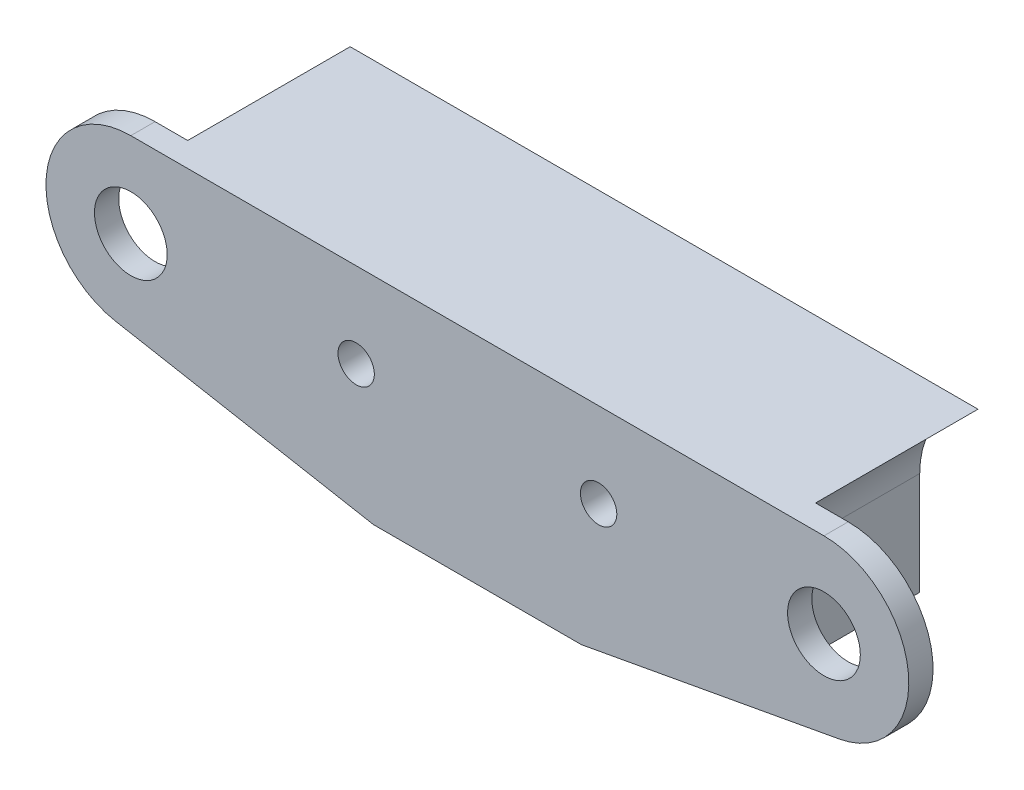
ISO-10303-21;
HEADER;
FILE_DESCRIPTION(('STEP AP214'),'2;1');
FILE_NAME('part.step','',(''),(''),'','','');
FILE_SCHEMA(('AUTOMOTIVE_DESIGN { 1 0 10303 214 1 1 1 1 }'));
ENDSEC;
DATA;
#1=APPLICATION_CONTEXT('core data for automotive mechanical design processes');
#2=APPLICATION_PROTOCOL_DEFINITION('international standard','automotive_design',2000,#1);
#3=PRODUCT_CONTEXT('',#1,'mechanical');
#4=PRODUCT('Part','Part','',(#3));
#5=PRODUCT_RELATED_PRODUCT_CATEGORY('part','',(#4));
#6=PRODUCT_DEFINITION_FORMATION('','',#4);
#7=PRODUCT_DEFINITION_CONTEXT('part definition',#1,'design');
#8=PRODUCT_DEFINITION('design','',#6,#7);
#9=PRODUCT_DEFINITION_SHAPE('','',#8);
#10=(LENGTH_UNIT() NAMED_UNIT(*) SI_UNIT(.MILLI.,.METRE.));
#11=(NAMED_UNIT(*) PLANE_ANGLE_UNIT() SI_UNIT($,.RADIAN.));
#12=(NAMED_UNIT(*) SI_UNIT($,.STERADIAN.) SOLID_ANGLE_UNIT());
#13=UNCERTAINTY_MEASURE_WITH_UNIT(LENGTH_MEASURE(1.E-05),#10,'distance_accuracy_value','');
#14=(GEOMETRIC_REPRESENTATION_CONTEXT(3) GLOBAL_UNCERTAINTY_ASSIGNED_CONTEXT((#13)) GLOBAL_UNIT_ASSIGNED_CONTEXT((#10,
#11,#12)) REPRESENTATION_CONTEXT('',''));
#15=CARTESIAN_POINT('',(0.,0.,0.));
#16=DIRECTION('',(0.,0.,1.));
#17=DIRECTION('',(1.,0.,0.));
#18=AXIS2_PLACEMENT_3D('',#15,#16,#17);
#19=CARTESIAN_POINT('',(28.5875999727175,51.1546126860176,5.));
#20=DIRECTION('',(0.,0.,1.));
#21=DIRECTION('',(1.,0.,0.));
#22=AXIS2_PLACEMENT_3D('',#19,#20,#21);
#23=PLANE('',#22);
#24=CARTESIAN_POINT('',(-28.5875999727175,51.1546126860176,5.));
#25=DIRECTION('',(0.,0.,1.));
#26=DIRECTION('',(1.,0.,0.));
#27=AXIS2_PLACEMENT_3D('',#24,#25,#26);
#28=CIRCLE('',#27,3.00000000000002);
#29=CARTESIAN_POINT('',(-25.5875999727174,51.1546126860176,5.));
#30=VERTEX_POINT('',#29);
#31=EDGE_CURVE('E386',#30,#30,#28,.T.);
#32=ORIENTED_EDGE('',*,*,#31,.T.);
#33=EDGE_LOOP('',(#32));
#34=FACE_BOUND('',#33,.T.);
#35=CARTESIAN_POINT('',(-28.5875999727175,51.1546126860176,5.));
#36=DIRECTION('',(0.,0.,1.));
#37=DIRECTION('',(-1.,0.,0.));
#38=AXIS2_PLACEMENT_3D('',#35,#36,#37);
#39=CIRCLE('',#38,7.5);
#40=CARTESIAN_POINT('',(-21.0875999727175,51.1546126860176,5.));
#41=VERTEX_POINT('',#40);
#42=CARTESIAN_POINT('',(-25.8950175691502,58.1546126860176,5.));
#43=VERTEX_POINT('',#42);
#44=EDGE_CURVE('E103',#41,#43,#39,.T.);
#45=ORIENTED_EDGE('',*,*,#44,.F.);
#46=DIRECTION('',(0.,1.,0.));
#47=VECTOR('',#46,1.);
#48=CARTESIAN_POINT('',(-21.0875999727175,51.1546126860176,5.));
#49=LINE('',#48,#47);
#50=CARTESIAN_POINT('',(-21.0875999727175,42.6652459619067,5.));
#51=VERTEX_POINT('',#50);
#52=EDGE_CURVE('E322',#51,#41,#49,.T.);
#53=ORIENTED_EDGE('',*,*,#52,.F.);
#54=DIRECTION('',(-0.983652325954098,0.180078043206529,0.));
#55=VECTOR('',#54,1.);
#56=CARTESIAN_POINT('',(-29.8481462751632,44.2690464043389,5.));
#57=LINE('',#56,#55);
#58=CARTESIAN_POINT('',(-29.8481462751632,44.2690464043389,5.));
#59=VERTEX_POINT('',#58);
#60=EDGE_CURVE('E348',#51,#59,#57,.T.);
#61=ORIENTED_EDGE('',*,*,#60,.T.);
#62=CARTESIAN_POINT('',(-28.5875999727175,51.1546126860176,5.));
#63=DIRECTION('',(0.,0.,1.));
#64=DIRECTION('',(1.,0.,0.));
#65=AXIS2_PLACEMENT_3D('',#62,#63,#64);
#66=CIRCLE('',#65,7.);
#67=CARTESIAN_POINT('',(-28.5875999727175,58.1546126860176,5.));
#68=VERTEX_POINT('',#67);
#69=EDGE_CURVE('E346',#59,#68,#66,.F.);
#70=ORIENTED_EDGE('',*,*,#69,.T.);
#71=DIRECTION('',(1.,0.,0.));
#72=VECTOR('',#71,1.);
#73=CARTESIAN_POINT('',(28.5875999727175,58.1546126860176,5.));
#74=LINE('',#73,#72);
#75=EDGE_CURVE('E342',#68,#43,#74,.T.);
#76=ORIENTED_EDGE('',*,*,#75,.T.);
#77=EDGE_LOOP('',(#45,#53,#61,#70,#76));
#78=FACE_BOUND('',#77,.T.);
#79=ADVANCED_FACE('F88',(#34,#78),#23,.F.);
#80=CARTESIAN_POINT('',(28.5875999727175,51.1546126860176,5.));
#81=DIRECTION('',(0.,0.,1.));
#82=DIRECTION('',(1.,0.,0.));
#83=AXIS2_PLACEMENT_3D('',#80,#81,#82);
#84=CIRCLE('',#83,3.00000000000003);
#85=CARTESIAN_POINT('',(31.5875999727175,51.1546126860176,5.));
#86=VERTEX_POINT('',#85);
#87=EDGE_CURVE('E344',#86,#86,#84,.T.);
#88=ORIENTED_EDGE('',*,*,#87,.T.);
#89=EDGE_LOOP('',(#88));
#90=FACE_BOUND('',#89,.T.);
#91=CARTESIAN_POINT('',(28.5875999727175,51.1546126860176,5.));
#92=DIRECTION('',(0.,0.,1.));
#93=DIRECTION('',(-1.,0.,0.));
#94=AXIS2_PLACEMENT_3D('',#91,#92,#93);
#95=CIRCLE('',#94,7.5);
#96=CARTESIAN_POINT('',(25.8950175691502,58.1546126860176,5.));
#97=VERTEX_POINT('',#96);
#98=CARTESIAN_POINT('',(21.0875999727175,51.1546126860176,5.));
#99=VERTEX_POINT('',#98);
#100=EDGE_CURVE('E244',#97,#99,#95,.T.);
#101=ORIENTED_EDGE('',*,*,#100,.F.);
#102=CARTESIAN_POINT('',(28.5875999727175,58.1546126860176,5.));
#103=VERTEX_POINT('',#102);
#104=EDGE_CURVE('E345',#97,#103,#74,.T.);
#105=ORIENTED_EDGE('',*,*,#104,.T.);
#106=CARTESIAN_POINT('',(28.5875999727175,51.1546126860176,5.));
#107=DIRECTION('',(0.,0.,1.));
#108=DIRECTION('',(1.,0.,0.));
#109=AXIS2_PLACEMENT_3D('',#106,#107,#108);
#110=CIRCLE('',#109,7.);
#111=CARTESIAN_POINT('',(29.8481462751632,44.2690464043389,5.));
#112=VERTEX_POINT('',#111);
#113=EDGE_CURVE('E353',#103,#112,#110,.F.);
#114=ORIENTED_EDGE('',*,*,#113,.T.);
#115=DIRECTION('',(-0.983652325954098,-0.180078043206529,0.));
#116=VECTOR('',#115,1.);
#117=CARTESIAN_POINT('',(8.57466035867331,40.3744917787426,5.));
#118=LINE('',#117,#116);
#119=CARTESIAN_POINT('',(21.0875999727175,42.6652459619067,5.));
#120=VERTEX_POINT('',#119);
#121=EDGE_CURVE('E351',#112,#120,#118,.T.);
#122=ORIENTED_EDGE('',*,*,#121,.T.);
#123=DIRECTION('',(0.,-1.,0.));
#124=VECTOR('',#123,1.);
#125=CARTESIAN_POINT('',(21.0875999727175,51.1546126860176,5.));
#126=LINE('',#125,#124);
#127=EDGE_CURVE('E111',#99,#120,#126,.T.);
#128=ORIENTED_EDGE('',*,*,#127,.F.);
#129=EDGE_LOOP('',(#101,#105,#114,#122,#128));
#130=FACE_BOUND('',#129,.T.);
#131=ADVANCED_FACE('F403',(#90,#130),#23,.F.);
#132=CARTESIAN_POINT('',(28.5875999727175,51.1546126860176,7.));
#133=DIRECTION('',(0.,0.,1.));
#134=DIRECTION('',(1.,0.,0.));
#135=AXIS2_PLACEMENT_3D('',#132,#133,#134);
#136=PLANE('',#135);
#137=CARTESIAN_POINT('',(10.,51.1546126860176,7.));
#138=DIRECTION('',(0.,0.,-1.));
#139=DIRECTION('',(-1.,0.,0.));
#140=AXIS2_PLACEMENT_3D('',#137,#138,#139);
#141=CIRCLE('',#140,1.5);
#142=CARTESIAN_POINT('',(8.5,51.1546126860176,7.));
#143=VERTEX_POINT('',#142);
#144=EDGE_CURVE('E642',#143,#143,#141,.T.);
#145=ORIENTED_EDGE('',*,*,#144,.T.);
#146=EDGE_LOOP('',(#145));
#147=FACE_BOUND('',#146,.T.);
#148=CARTESIAN_POINT('',(-10.,51.1546126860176,7.));
#149=DIRECTION('',(0.,0.,-1.));
#150=DIRECTION('',(-1.,0.,0.));
#151=AXIS2_PLACEMENT_3D('',#148,#149,#150);
#152=CIRCLE('',#151,1.5);
#153=CARTESIAN_POINT('',(-11.5,51.1546126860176,7.));
#154=VERTEX_POINT('',#153);
#155=EDGE_CURVE('E640',#154,#154,#152,.T.);
#156=ORIENTED_EDGE('',*,*,#155,.T.);
#157=EDGE_LOOP('',(#156));
#158=FACE_BOUND('',#157,.T.);
#159=CARTESIAN_POINT('',(-28.5875999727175,51.1546126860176,7.));
#160=DIRECTION('',(0.,0.,1.));
#161=DIRECTION('',(1.,0.,0.));
#162=AXIS2_PLACEMENT_3D('',#159,#160,#161);
#163=CIRCLE('',#162,3.00000000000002);
#164=CARTESIAN_POINT('',(-25.5875999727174,51.1546126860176,7.));
#165=VERTEX_POINT('',#164);
#166=EDGE_CURVE('E389',#165,#165,#163,.T.);
#167=ORIENTED_EDGE('',*,*,#166,.F.);
#168=EDGE_LOOP('',(#167));
#169=FACE_BOUND('',#168,.T.);
#170=CARTESIAN_POINT('',(28.5875999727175,51.1546126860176,7.));
#171=DIRECTION('',(0.,0.,1.));
#172=DIRECTION('',(1.,0.,0.));
#173=AXIS2_PLACEMENT_3D('',#170,#171,#172);
#174=CIRCLE('',#173,3.00000000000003);
#175=CARTESIAN_POINT('',(31.5875999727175,51.1546126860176,7.));
#176=VERTEX_POINT('',#175);
#177=EDGE_CURVE('E383',#176,#176,#174,.T.);
#178=ORIENTED_EDGE('',*,*,#177,.F.);
#179=EDGE_LOOP('',(#178));
#180=FACE_BOUND('',#179,.T.);
#181=CARTESIAN_POINT('',(28.5875999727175,51.1546126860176,7.));
#182=DIRECTION('',(0.,0.,1.));
#183=DIRECTION('',(1.,0.,0.));
#184=AXIS2_PLACEMENT_3D('',#181,#182,#183);
#185=CIRCLE('',#184,7.);
#186=CARTESIAN_POINT('',(29.8481462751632,44.2690464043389,7.));
#187=VERTEX_POINT('',#186);
#188=CARTESIAN_POINT('',(28.5875999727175,58.1546126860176,7.));
#189=VERTEX_POINT('',#188);
#190=EDGE_CURVE('E341',#187,#189,#185,.T.);
#191=ORIENTED_EDGE('',*,*,#190,.T.);
#192=DIRECTION('',(-1.,0.,0.));
#193=VECTOR('',#192,1.);
#194=CARTESIAN_POINT('',(28.5875999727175,58.1546126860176,7.));
#195=LINE('',#194,#193);
#196=CARTESIAN_POINT('',(-28.5875999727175,58.1546126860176,7.));
#197=VERTEX_POINT('',#196);
#198=EDGE_CURVE('E357',#189,#197,#195,.T.);
#199=ORIENTED_EDGE('',*,*,#198,.T.);
#200=CARTESIAN_POINT('',(-28.5875999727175,51.1546126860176,7.));
#201=DIRECTION('',(0.,0.,1.));
#202=DIRECTION('',(1.,0.,0.));
#203=AXIS2_PLACEMENT_3D('',#200,#201,#202);
#204=CIRCLE('',#203,7.);
#205=CARTESIAN_POINT('',(-29.8481462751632,44.2690464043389,7.));
#206=VERTEX_POINT('',#205);
#207=EDGE_CURVE('E360',#197,#206,#204,.T.);
#208=ORIENTED_EDGE('',*,*,#207,.T.);
#209=DIRECTION('',(0.983652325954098,-0.180078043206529,0.));
#210=VECTOR('',#209,1.);
#211=CARTESIAN_POINT('',(-29.8481462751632,44.2690464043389,7.));
#212=LINE('',#211,#210);
#213=CARTESIAN_POINT('',(-8.57466035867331,40.3744917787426,7.));
#214=VERTEX_POINT('',#213);
#215=EDGE_CURVE('E363',#206,#214,#212,.T.);
#216=ORIENTED_EDGE('',*,*,#215,.T.);
#217=DIRECTION('',(1.,0.,0.));
#218=VECTOR('',#217,1.);
#219=CARTESIAN_POINT('',(-8.57466035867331,40.3744917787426,7.));
#220=LINE('',#219,#218);
#221=CARTESIAN_POINT('',(8.57466035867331,40.3744917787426,7.));
#222=VERTEX_POINT('',#221);
#223=EDGE_CURVE('E366',#214,#222,#220,.T.);
#224=ORIENTED_EDGE('',*,*,#223,.T.);
#225=DIRECTION('',(0.983652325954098,0.180078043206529,0.));
#226=VECTOR('',#225,1.);
#227=CARTESIAN_POINT('',(8.57466035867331,40.3744917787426,7.));
#228=LINE('',#227,#226);
#229=EDGE_CURVE('E369',#222,#187,#228,.T.);
#230=ORIENTED_EDGE('',*,*,#229,.T.);
#231=EDGE_LOOP('',(#191,#199,#208,#216,#224,#230));
#232=FACE_BOUND('',#231,.T.);
#233=ADVANCED_FACE('F441',(#147,#158,#169,#180,#232),#136,.T.);
#234=CARTESIAN_POINT('',(-28.5875999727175,51.1546126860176,7.));
#235=DIRECTION('',(0.,0.,-1.));
#236=DIRECTION('',(-1.,0.,0.));
#237=AXIS2_PLACEMENT_3D('',#234,#235,#236);
#238=CYLINDRICAL_SURFACE('',#237,3.00000000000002);
#239=ORIENTED_EDGE('',*,*,#166,.T.);
#240=EDGE_LOOP('',(#239));
#241=FACE_BOUND('',#240,.T.);
#242=ORIENTED_EDGE('',*,*,#31,.F.);
#243=EDGE_LOOP('',(#242));
#244=FACE_BOUND('',#243,.T.);
#245=ADVANCED_FACE('F445',(#241,#244),#238,.F.);
#246=CARTESIAN_POINT('',(28.5875999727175,51.1546126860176,7.));
#247=DIRECTION('',(0.,0.,-1.));
#248=DIRECTION('',(-1.,0.,0.));
#249=AXIS2_PLACEMENT_3D('',#246,#247,#248);
#250=CYLINDRICAL_SURFACE('',#249,3.00000000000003);
#251=ORIENTED_EDGE('',*,*,#177,.T.);
#252=EDGE_LOOP('',(#251));
#253=FACE_BOUND('',#252,.T.);
#254=ORIENTED_EDGE('',*,*,#87,.F.);
#255=EDGE_LOOP('',(#254));
#256=FACE_BOUND('',#255,.T.);
#257=ADVANCED_FACE('F447',(#253,#256),#250,.F.);
#258=CARTESIAN_POINT('',(28.5875999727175,58.1546126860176,-68.362400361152));
#259=DIRECTION('',(0.,1.,0.));
#260=DIRECTION('',(0.,0.,1.));
#261=AXIS2_PLACEMENT_3D('',#258,#259,#260);
#262=PLANE('',#261);
#263=ORIENTED_EDGE('',*,*,#75,.F.);
#264=DIRECTION('',(0.,0.,1.));
#265=VECTOR('',#264,1.);
#266=CARTESIAN_POINT('',(-28.5875999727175,58.1546126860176,-68.362400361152));
#267=LINE('',#266,#265);
#268=EDGE_CURVE('E380',#68,#197,#267,.T.);
#269=ORIENTED_EDGE('',*,*,#268,.T.);
#270=ORIENTED_EDGE('',*,*,#198,.F.);
#271=DIRECTION('',(0.,0.,1.));
#272=VECTOR('',#271,1.);
#273=CARTESIAN_POINT('',(28.5875999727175,58.1546126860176,-68.362400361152));
#274=LINE('',#273,#272);
#275=EDGE_CURVE('E372',#103,#189,#274,.T.);
#276=ORIENTED_EDGE('',*,*,#275,.F.);
#277=ORIENTED_EDGE('',*,*,#104,.F.);
#278=DIRECTION('',(0.,0.,1.));
#279=VECTOR('',#278,1.);
#280=CARTESIAN_POINT('',(25.8950175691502,58.1546126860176,-8.4));
#281=LINE('',#280,#279);
#282=CARTESIAN_POINT('',(25.8950175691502,58.1546126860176,-8.4));
#283=VERTEX_POINT('',#282);
#284=EDGE_CURVE('E318',#283,#97,#281,.T.);
#285=ORIENTED_EDGE('',*,*,#284,.F.);
#286=DIRECTION('',(1.,0.,0.));
#287=VECTOR('',#286,1.);
#288=CARTESIAN_POINT('',(25.8950175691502,58.1546126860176,-8.4));
#289=LINE('',#288,#287);
#290=CARTESIAN_POINT('',(-25.8950175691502,58.1546126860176,-8.4));
#291=VERTEX_POINT('',#290);
#292=EDGE_CURVE('E316',#291,#283,#289,.T.);
#293=ORIENTED_EDGE('',*,*,#292,.F.);
#294=DIRECTION('',(0.,0.,1.));
#295=VECTOR('',#294,1.);
#296=CARTESIAN_POINT('',(-25.8950175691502,58.1546126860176,-8.4));
#297=LINE('',#296,#295);
#298=EDGE_CURVE('E327',#291,#43,#297,.T.);
#299=ORIENTED_EDGE('',*,*,#298,.T.);
#300=EDGE_LOOP('',(#263,#269,#270,#276,#277,#285,#293,#299));
#301=FACE_BOUND('',#300,.T.);
#302=ADVANCED_FACE('F454',(#301),#262,.T.);
#303=CARTESIAN_POINT('',(-28.5875999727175,51.1546126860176,-68.362400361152));
#304=DIRECTION('',(0.,0.,1.));
#305=DIRECTION('',(1.,0.,0.));
#306=AXIS2_PLACEMENT_3D('',#303,#304,#305);
#307=CYLINDRICAL_SURFACE('',#306,7.);
#308=ORIENTED_EDGE('',*,*,#69,.F.);
#309=DIRECTION('',(0.,0.,1.));
#310=VECTOR('',#309,1.);
#311=CARTESIAN_POINT('',(-29.8481462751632,44.2690464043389,-68.362400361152));
#312=LINE('',#311,#310);
#313=EDGE_CURVE('E378',#59,#206,#312,.T.);
#314=ORIENTED_EDGE('',*,*,#313,.T.);
#315=ORIENTED_EDGE('',*,*,#207,.F.);
#316=ORIENTED_EDGE('',*,*,#268,.F.);
#317=EDGE_LOOP('',(#308,#314,#315,#316));
#318=FACE_BOUND('',#317,.T.);
#319=ADVANCED_FACE('F466',(#318),#307,.T.);
#320=CARTESIAN_POINT('',(-29.8481462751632,44.2690464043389,-68.362400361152));
#321=DIRECTION('',(-0.180078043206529,-0.983652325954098,0.));
#322=DIRECTION('',(0.983652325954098,-0.180078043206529,0.));
#323=AXIS2_PLACEMENT_3D('',#320,#321,#322);
#324=PLANE('',#323);
#325=ORIENTED_EDGE('',*,*,#60,.F.);
#326=DIRECTION('',(0.,0.,1.));
#327=VECTOR('',#326,1.);
#328=CARTESIAN_POINT('',(-21.0875999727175,42.6652459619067,-8.4));
#329=LINE('',#328,#327);
#330=CARTESIAN_POINT('',(-21.0875999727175,42.6652459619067,-8.4));
#331=VERTEX_POINT('',#330);
#332=EDGE_CURVE('E333',#331,#51,#329,.T.);
#333=ORIENTED_EDGE('',*,*,#332,.F.);
#334=DIRECTION('',(-0.983652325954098,0.180078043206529,0.));
#335=VECTOR('',#334,1.);
#336=CARTESIAN_POINT('',(-8.5746603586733,40.3744917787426,-8.4));
#337=LINE('',#336,#335);
#338=CARTESIAN_POINT('',(-8.5746603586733,40.3744917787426,-8.4));
#339=VERTEX_POINT('',#338);
#340=EDGE_CURVE('E310',#339,#331,#337,.T.);
#341=ORIENTED_EDGE('',*,*,#340,.F.);
#342=DIRECTION('',(0.,0.,1.));
#343=VECTOR('',#342,1.);
#344=CARTESIAN_POINT('',(-8.57466035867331,40.3744917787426,-68.362400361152));
#345=LINE('',#344,#343);
#346=EDGE_CURVE('E376',#339,#214,#345,.T.);
#347=ORIENTED_EDGE('',*,*,#346,.T.);
#348=ORIENTED_EDGE('',*,*,#215,.F.);
#349=ORIENTED_EDGE('',*,*,#313,.F.);
#350=EDGE_LOOP('',(#325,#333,#341,#347,#348,#349));
#351=FACE_BOUND('',#350,.T.);
#352=ADVANCED_FACE('F470',(#351),#324,.T.);
#353=CARTESIAN_POINT('',(-8.57466035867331,40.3744917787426,-68.362400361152));
#354=DIRECTION('',(0.,-1.,0.));
#355=DIRECTION('',(0.,0.,-1.));
#356=AXIS2_PLACEMENT_3D('',#353,#354,#355);
#357=PLANE('',#356);
#358=ORIENTED_EDGE('',*,*,#346,.F.);
#359=DIRECTION('',(-1.,0.,0.));
#360=VECTOR('',#359,1.);
#361=CARTESIAN_POINT('',(8.57466035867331,40.3744917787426,-8.4));
#362=LINE('',#361,#360);
#363=CARTESIAN_POINT('',(8.57466035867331,40.3744917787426,-8.4));
#364=VERTEX_POINT('',#363);
#365=EDGE_CURVE('E307',#364,#339,#362,.T.);
#366=ORIENTED_EDGE('',*,*,#365,.F.);
#367=DIRECTION('',(0.,0.,1.));
#368=VECTOR('',#367,1.);
#369=CARTESIAN_POINT('',(8.57466035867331,40.3744917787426,-68.362400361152));
#370=LINE('',#369,#368);
#371=EDGE_CURVE('E374',#364,#222,#370,.T.);
#372=ORIENTED_EDGE('',*,*,#371,.T.);
#373=ORIENTED_EDGE('',*,*,#223,.F.);
#374=EDGE_LOOP('',(#358,#366,#372,#373));
#375=FACE_BOUND('',#374,.T.);
#376=ADVANCED_FACE('F474',(#375),#357,.T.);
#377=CARTESIAN_POINT('',(8.57466035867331,40.3744917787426,-68.362400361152));
#378=DIRECTION('',(0.180078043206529,-0.983652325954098,0.));
#379=DIRECTION('',(0.983652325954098,0.180078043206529,0.));
#380=AXIS2_PLACEMENT_3D('',#377,#378,#379);
#381=PLANE('',#380);
#382=ORIENTED_EDGE('',*,*,#121,.F.);
#383=DIRECTION('',(0.,0.,1.));
#384=VECTOR('',#383,1.);
#385=CARTESIAN_POINT('',(29.8481462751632,44.2690464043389,-68.362400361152));
#386=LINE('',#385,#384);
#387=EDGE_CURVE('E349',#112,#187,#386,.T.);
#388=ORIENTED_EDGE('',*,*,#387,.T.);
#389=ORIENTED_EDGE('',*,*,#229,.F.);
#390=ORIENTED_EDGE('',*,*,#371,.F.);
#391=DIRECTION('',(-0.983652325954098,-0.180078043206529,0.));
#392=VECTOR('',#391,1.);
#393=CARTESIAN_POINT('',(8.57466035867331,40.3744917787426,-8.4));
#394=LINE('',#393,#392);
#395=CARTESIAN_POINT('',(21.0875999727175,42.6652459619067,-8.4));
#396=VERTEX_POINT('',#395);
#397=EDGE_CURVE('E304',#396,#364,#394,.T.);
#398=ORIENTED_EDGE('',*,*,#397,.F.);
#399=DIRECTION('',(0.,0.,1.));
#400=VECTOR('',#399,1.);
#401=CARTESIAN_POINT('',(21.0875999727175,42.6652459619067,-8.4));
#402=LINE('',#401,#400);
#403=EDGE_CURVE('E336',#396,#120,#402,.T.);
#404=ORIENTED_EDGE('',*,*,#403,.T.);
#405=EDGE_LOOP('',(#382,#388,#389,#390,#398,#404));
#406=FACE_BOUND('',#405,.T.);
#407=ADVANCED_FACE('F462',(#406),#381,.T.);
#408=CARTESIAN_POINT('',(28.5875999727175,51.1546126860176,-68.362400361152));
#409=DIRECTION('',(0.,0.,1.));
#410=DIRECTION('',(1.,0.,0.));
#411=AXIS2_PLACEMENT_3D('',#408,#409,#410);
#412=CYLINDRICAL_SURFACE('',#411,7.);
#413=ORIENTED_EDGE('',*,*,#113,.F.);
#414=ORIENTED_EDGE('',*,*,#275,.T.);
#415=ORIENTED_EDGE('',*,*,#190,.F.);
#416=ORIENTED_EDGE('',*,*,#387,.F.);
#417=EDGE_LOOP('',(#413,#414,#415,#416));
#418=FACE_BOUND('',#417,.T.);
#419=ADVANCED_FACE('F459',(#418),#412,.T.);
#420=CARTESIAN_POINT('',(28.5875999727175,51.1546126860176,-8.4));
#421=DIRECTION('',(0.,0.,-1.));
#422=DIRECTION('',(-1.,0.,0.));
#423=AXIS2_PLACEMENT_3D('',#420,#421,#422);
#424=PLANE('',#423);
#425=CARTESIAN_POINT('',(28.5875999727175,51.1546126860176,-8.4));
#426=DIRECTION('',(0.,0.,1.));
#427=DIRECTION('',(-1.,0.,0.));
#428=AXIS2_PLACEMENT_3D('',#425,#426,#427);
#429=CIRCLE('',#428,7.5);
#430=CARTESIAN_POINT('',(21.0875999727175,51.1546126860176,-8.4));
#431=VERTEX_POINT('',#430);
#432=EDGE_CURVE('E299',#283,#431,#429,.T.);
#433=ORIENTED_EDGE('',*,*,#432,.T.);
#434=DIRECTION('',(0.,-1.,0.));
#435=VECTOR('',#434,1.);
#436=CARTESIAN_POINT('',(21.0875999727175,51.1546126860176,-8.4));
#437=LINE('',#436,#435);
#438=EDGE_CURVE('E302',#431,#396,#437,.T.);
#439=ORIENTED_EDGE('',*,*,#438,.T.);
#440=ORIENTED_EDGE('',*,*,#397,.T.);
#441=ORIENTED_EDGE('',*,*,#365,.T.);
#442=ORIENTED_EDGE('',*,*,#340,.T.);
#443=DIRECTION('',(0.,1.,0.));
#444=VECTOR('',#443,1.);
#445=CARTESIAN_POINT('',(-21.0875999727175,51.1546126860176,-8.4));
#446=LINE('',#445,#444);
#447=CARTESIAN_POINT('',(-21.0875999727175,51.1546126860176,-8.4));
#448=VERTEX_POINT('',#447);
#449=EDGE_CURVE('E312',#331,#448,#446,.T.);
#450=ORIENTED_EDGE('',*,*,#449,.T.);
#451=CARTESIAN_POINT('',(-28.5875999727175,51.1546126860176,-8.4));
#452=DIRECTION('',(0.,0.,1.));
#453=DIRECTION('',(-1.,0.,0.));
#454=AXIS2_PLACEMENT_3D('',#451,#452,#453);
#455=CIRCLE('',#454,7.5);
#456=EDGE_CURVE('E314',#448,#291,#455,.T.);
#457=ORIENTED_EDGE('',*,*,#456,.T.);
#458=ORIENTED_EDGE('',*,*,#292,.T.);
#459=EDGE_LOOP('',(#433,#439,#440,#441,#442,#450,#457,#458));
#460=FACE_BOUND('',#459,.T.);
#461=DIRECTION('',(0.,-1.,0.));
#462=VECTOR('',#461,1.);
#463=CARTESIAN_POINT('',(19.0875999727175,51.1546126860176,-8.4));
#464=LINE('',#463,#462);
#465=CARTESIAN_POINT('',(19.0875999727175,51.1546126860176,-8.4));
#466=VERTEX_POINT('',#465);
#467=CARTESIAN_POINT('',(19.0875999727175,44.3323430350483,-8.4));
#468=VERTEX_POINT('',#467);
#469=EDGE_CURVE('E236',#466,#468,#464,.T.);
#470=ORIENTED_EDGE('',*,*,#469,.F.);
#471=CARTESIAN_POINT('',(28.5875999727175,51.1546126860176,-8.4));
#472=DIRECTION('',(0.,0.,1.));
#473=DIRECTION('',(-1.,0.,0.));
#474=AXIS2_PLACEMENT_3D('',#471,#472,#473);
#475=CIRCLE('',#474,9.5);
#476=CARTESIAN_POINT('',(20.5098527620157,56.1546126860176,-8.4));
#477=VERTEX_POINT('',#476);
#478=EDGE_CURVE('E226',#477,#466,#475,.T.);
#479=ORIENTED_EDGE('',*,*,#478,.F.);
#480=DIRECTION('',(1.,0.,0.));
#481=VECTOR('',#480,1.);
#482=CARTESIAN_POINT('',(20.5098527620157,56.1546126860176,-8.4));
#483=LINE('',#482,#481);
#484=CARTESIAN_POINT('',(-20.5098527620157,56.1546126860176,-8.4));
#485=VERTEX_POINT('',#484);
#486=EDGE_CURVE('E264',#485,#477,#483,.T.);
#487=ORIENTED_EDGE('',*,*,#486,.F.);
#488=CARTESIAN_POINT('',(-28.5875999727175,51.1546126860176,-8.4));
#489=DIRECTION('',(0.,0.,1.));
#490=DIRECTION('',(-1.,0.,0.));
#491=AXIS2_PLACEMENT_3D('',#488,#489,#490);
#492=CIRCLE('',#491,9.5);
#493=CARTESIAN_POINT('',(-19.0875999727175,51.1546126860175,-8.4));
#494=VERTEX_POINT('',#493);
#495=EDGE_CURVE('E261',#494,#485,#492,.T.);
#496=ORIENTED_EDGE('',*,*,#495,.F.);
#497=DIRECTION('',(0.,1.,0.));
#498=VECTOR('',#497,1.);
#499=CARTESIAN_POINT('',(-19.0875999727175,51.1546126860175,-8.4));
#500=LINE('',#499,#498);
#501=CARTESIAN_POINT('',(-19.0875999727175,44.3323430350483,-8.4));
#502=VERTEX_POINT('',#501);
#503=EDGE_CURVE('E259',#502,#494,#500,.T.);
#504=ORIENTED_EDGE('',*,*,#503,.F.);
#505=DIRECTION('',(-0.983652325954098,0.180078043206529,0.));
#506=VECTOR('',#505,1.);
#507=CARTESIAN_POINT('',(-8.39309825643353,42.3744917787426,-8.4));
#508=LINE('',#507,#506);
#509=CARTESIAN_POINT('',(-8.39309825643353,42.3744917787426,-8.4));
#510=VERTEX_POINT('',#509);
#511=EDGE_CURVE('E257',#510,#502,#508,.T.);
#512=ORIENTED_EDGE('',*,*,#511,.F.);
#513=DIRECTION('',(-1.,0.,0.));
#514=VECTOR('',#513,1.);
#515=CARTESIAN_POINT('',(8.39309825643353,42.3744917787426,-8.4));
#516=LINE('',#515,#514);
#517=CARTESIAN_POINT('',(8.39309825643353,42.3744917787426,-8.4));
#518=VERTEX_POINT('',#517);
#519=EDGE_CURVE('E252',#518,#510,#516,.T.);
#520=ORIENTED_EDGE('',*,*,#519,.F.);
#521=DIRECTION('',(-0.983652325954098,-0.180078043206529,0.));
#522=VECTOR('',#521,1.);
#523=CARTESIAN_POINT('',(8.39309825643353,42.3744917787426,-8.4));
#524=LINE('',#523,#522);
#525=EDGE_CURVE('E250',#468,#518,#524,.T.);
#526=ORIENTED_EDGE('',*,*,#525,.F.);
#527=EDGE_LOOP('',(#470,#479,#487,#496,#504,#512,#520,#526));
#528=FACE_BOUND('',#527,.T.);
#529=ADVANCED_FACE('F248',(#460,#528),#424,.T.);
#530=CARTESIAN_POINT('',(28.5875999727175,51.1546126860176,-8.4));
#531=DIRECTION('',(0.,0.,1.));
#532=DIRECTION('',(1.,0.,0.));
#533=AXIS2_PLACEMENT_3D('',#530,#531,#532);
#534=CYLINDRICAL_SURFACE('',#533,7.5);
#535=ORIENTED_EDGE('',*,*,#100,.T.);
#536=DIRECTION('',(0.,0.,1.));
#537=VECTOR('',#536,1.);
#538=CARTESIAN_POINT('',(21.0875999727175,51.1546126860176,-8.4));
#539=LINE('',#538,#537);
#540=EDGE_CURVE('E339',#431,#99,#539,.T.);
#541=ORIENTED_EDGE('',*,*,#540,.F.);
#542=ORIENTED_EDGE('',*,*,#432,.F.);
#543=ORIENTED_EDGE('',*,*,#284,.T.);
#544=EDGE_LOOP('',(#535,#541,#542,#543));
#545=FACE_BOUND('',#544,.T.);
#546=ADVANCED_FACE('F482',(#545),#534,.F.);
#547=CARTESIAN_POINT('',(21.0875999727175,51.1546126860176,-8.4));
#548=DIRECTION('',(-1.,0.,0.));
#549=DIRECTION('',(0.,0.,1.));
#550=AXIS2_PLACEMENT_3D('',#547,#548,#549);
#551=PLANE('',#550);
#552=ORIENTED_EDGE('',*,*,#127,.T.);
#553=ORIENTED_EDGE('',*,*,#403,.F.);
#554=ORIENTED_EDGE('',*,*,#438,.F.);
#555=ORIENTED_EDGE('',*,*,#540,.T.);
#556=EDGE_LOOP('',(#552,#553,#554,#555));
#557=FACE_BOUND('',#556,.T.);
#558=ADVANCED_FACE('F485',(#557),#551,.F.);
#559=CARTESIAN_POINT('',(-21.0875999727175,51.1546126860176,-8.4));
#560=DIRECTION('',(1.,0.,0.));
#561=DIRECTION('',(0.,0.,-1.));
#562=AXIS2_PLACEMENT_3D('',#559,#560,#561);
#563=PLANE('',#562);
#564=ORIENTED_EDGE('',*,*,#52,.T.);
#565=DIRECTION('',(0.,0.,1.));
#566=VECTOR('',#565,1.);
#567=CARTESIAN_POINT('',(-21.0875999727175,51.1546126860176,-8.4));
#568=LINE('',#567,#566);
#569=EDGE_CURVE('E330',#448,#41,#568,.T.);
#570=ORIENTED_EDGE('',*,*,#569,.F.);
#571=ORIENTED_EDGE('',*,*,#449,.F.);
#572=ORIENTED_EDGE('',*,*,#332,.T.);
#573=EDGE_LOOP('',(#564,#570,#571,#572));
#574=FACE_BOUND('',#573,.T.);
#575=ADVANCED_FACE('F489',(#574),#563,.F.);
#576=CARTESIAN_POINT('',(-28.5875999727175,51.1546126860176,-8.4));
#577=DIRECTION('',(0.,0.,1.));
#578=DIRECTION('',(1.,0.,0.));
#579=AXIS2_PLACEMENT_3D('',#576,#577,#578);
#580=CYLINDRICAL_SURFACE('',#579,7.5);
#581=ORIENTED_EDGE('',*,*,#44,.T.);
#582=ORIENTED_EDGE('',*,*,#298,.F.);
#583=ORIENTED_EDGE('',*,*,#456,.F.);
#584=ORIENTED_EDGE('',*,*,#569,.T.);
#585=EDGE_LOOP('',(#581,#582,#583,#584));
#586=FACE_BOUND('',#585,.T.);
#587=ADVANCED_FACE('F493',(#586),#580,.F.);
#588=CARTESIAN_POINT('',(28.5875999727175,51.1546126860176,-8.4));
#589=DIRECTION('',(0.,0.,1.));
#590=DIRECTION('',(1.,0.,0.));
#591=AXIS2_PLACEMENT_3D('',#588,#589,#590);
#592=CYLINDRICAL_SURFACE('',#591,9.5);
#593=CARTESIAN_POINT('',(28.5875999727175,51.1546126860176,5.));
#594=DIRECTION('',(0.,0.,1.));
#595=DIRECTION('',(-1.,0.,0.));
#596=AXIS2_PLACEMENT_3D('',#593,#594,#595);
#597=CIRCLE('',#596,9.5);
#598=CARTESIAN_POINT('',(20.5098527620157,56.1546126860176,5.));
#599=VERTEX_POINT('',#598);
#600=CARTESIAN_POINT('',(19.0875999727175,51.1546126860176,5.));
#601=VERTEX_POINT('',#600);
#602=EDGE_CURVE('E266',#599,#601,#597,.T.);
#603=ORIENTED_EDGE('',*,*,#602,.F.);
#604=DIRECTION('',(0.,0.,1.));
#605=VECTOR('',#604,1.);
#606=CARTESIAN_POINT('',(20.5098527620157,56.1546126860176,-8.4));
#607=LINE('',#606,#605);
#608=EDGE_CURVE('E232',#477,#599,#607,.T.);
#609=ORIENTED_EDGE('',*,*,#608,.F.);
#610=ORIENTED_EDGE('',*,*,#478,.T.);
#611=DIRECTION('',(0.,0.,1.));
#612=VECTOR('',#611,1.);
#613=CARTESIAN_POINT('',(19.0875999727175,51.1546126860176,-8.4));
#614=LINE('',#613,#612);
#615=EDGE_CURVE('E230',#466,#601,#614,.T.);
#616=ORIENTED_EDGE('',*,*,#615,.T.);
#617=EDGE_LOOP('',(#603,#609,#610,#616));
#618=FACE_BOUND('',#617,.T.);
#619=ADVANCED_FACE('F229',(#618),#592,.T.);
#620=CARTESIAN_POINT('',(19.0875999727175,51.1546126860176,-8.4));
#621=DIRECTION('',(-1.,0.,0.));
#622=DIRECTION('',(0.,0.,1.));
#623=AXIS2_PLACEMENT_3D('',#620,#621,#622);
#624=PLANE('',#623);
#625=DIRECTION('',(0.,-1.,0.));
#626=VECTOR('',#625,1.);
#627=CARTESIAN_POINT('',(19.0875999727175,51.1546126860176,5.));
#628=LINE('',#627,#626);
#629=CARTESIAN_POINT('',(19.0875999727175,44.3323430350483,5.));
#630=VERTEX_POINT('',#629);
#631=EDGE_CURVE('E243',#601,#630,#628,.T.);
#632=ORIENTED_EDGE('',*,*,#631,.F.);
#633=ORIENTED_EDGE('',*,*,#615,.F.);
#634=ORIENTED_EDGE('',*,*,#469,.T.);
#635=DIRECTION('',(0.,0.,1.));
#636=VECTOR('',#635,1.);
#637=CARTESIAN_POINT('',(19.0875999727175,44.3323430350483,-8.4));
#638=LINE('',#637,#636);
#639=EDGE_CURVE('E245',#468,#630,#638,.T.);
#640=ORIENTED_EDGE('',*,*,#639,.T.);
#641=EDGE_LOOP('',(#632,#633,#634,#640));
#642=FACE_BOUND('',#641,.T.);
#643=ADVANCED_FACE('F240',(#642),#624,.T.);
#644=CARTESIAN_POINT('',(8.39309825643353,42.3744917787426,-8.4));
#645=DIRECTION('',(-0.180078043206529,0.983652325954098,0.));
#646=DIRECTION('',(-0.983652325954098,-0.180078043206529,0.));
#647=AXIS2_PLACEMENT_3D('',#644,#645,#646);
#648=PLANE('',#647);
#649=DIRECTION('',(-0.983652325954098,-0.180078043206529,0.));
#650=VECTOR('',#649,1.);
#651=CARTESIAN_POINT('',(8.39309825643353,42.3744917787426,5.));
#652=LINE('',#651,#650);
#653=CARTESIAN_POINT('',(8.39309825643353,42.3744917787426,5.));
#654=VERTEX_POINT('',#653);
#655=EDGE_CURVE('E270',#630,#654,#652,.T.);
#656=ORIENTED_EDGE('',*,*,#655,.F.);
#657=ORIENTED_EDGE('',*,*,#639,.F.);
#658=ORIENTED_EDGE('',*,*,#525,.T.);
#659=DIRECTION('',(0.,0.,1.));
#660=VECTOR('',#659,1.);
#661=CARTESIAN_POINT('',(8.39309825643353,42.3744917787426,-8.4));
#662=LINE('',#661,#660);
#663=EDGE_CURVE('E296',#518,#654,#662,.T.);
#664=ORIENTED_EDGE('',*,*,#663,.T.);
#665=EDGE_LOOP('',(#656,#657,#658,#664));
#666=FACE_BOUND('',#665,.T.);
#667=ADVANCED_FACE('F427',(#666),#648,.T.);
#668=CARTESIAN_POINT('',(8.39309825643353,42.3744917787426,-8.4));
#669=DIRECTION('',(0.,1.,0.));
#670=DIRECTION('',(0.,0.,1.));
#671=AXIS2_PLACEMENT_3D('',#668,#669,#670);
#672=PLANE('',#671);
#673=DIRECTION('',(-1.,0.,0.));
#674=VECTOR('',#673,1.);
#675=CARTESIAN_POINT('',(8.39309825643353,42.3744917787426,5.));
#676=LINE('',#675,#674);
#677=CARTESIAN_POINT('',(-8.39309825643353,42.3744917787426,5.));
#678=VERTEX_POINT('',#677);
#679=EDGE_CURVE('E273',#654,#678,#676,.T.);
#680=ORIENTED_EDGE('',*,*,#679,.F.);
#681=ORIENTED_EDGE('',*,*,#663,.F.);
#682=ORIENTED_EDGE('',*,*,#519,.T.);
#683=DIRECTION('',(0.,0.,1.));
#684=VECTOR('',#683,1.);
#685=CARTESIAN_POINT('',(-8.39309825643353,42.3744917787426,-8.4));
#686=LINE('',#685,#684);
#687=EDGE_CURVE('E294',#510,#678,#686,.T.);
#688=ORIENTED_EDGE('',*,*,#687,.T.);
#689=EDGE_LOOP('',(#680,#681,#682,#688));
#690=FACE_BOUND('',#689,.T.);
#691=ADVANCED_FACE('F424',(#690),#672,.T.);
#692=CARTESIAN_POINT('',(-8.39309825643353,42.3744917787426,-8.4));
#693=DIRECTION('',(0.180078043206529,0.983652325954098,0.));
#694=DIRECTION('',(-0.983652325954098,0.180078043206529,0.));
#695=AXIS2_PLACEMENT_3D('',#692,#693,#694);
#696=PLANE('',#695);
#697=DIRECTION('',(-0.983652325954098,0.180078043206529,0.));
#698=VECTOR('',#697,1.);
#699=CARTESIAN_POINT('',(-8.39309825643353,42.3744917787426,5.));
#700=LINE('',#699,#698);
#701=CARTESIAN_POINT('',(-19.0875999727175,44.3323430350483,5.));
#702=VERTEX_POINT('',#701);
#703=EDGE_CURVE('E276',#678,#702,#700,.T.);
#704=ORIENTED_EDGE('',*,*,#703,.F.);
#705=ORIENTED_EDGE('',*,*,#687,.F.);
#706=ORIENTED_EDGE('',*,*,#511,.T.);
#707=DIRECTION('',(0.,0.,1.));
#708=VECTOR('',#707,1.);
#709=CARTESIAN_POINT('',(-19.0875999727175,44.3323430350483,-8.4));
#710=LINE('',#709,#708);
#711=EDGE_CURVE('E292',#502,#702,#710,.T.);
#712=ORIENTED_EDGE('',*,*,#711,.T.);
#713=EDGE_LOOP('',(#704,#705,#706,#712));
#714=FACE_BOUND('',#713,.T.);
#715=ADVANCED_FACE('F419',(#714),#696,.T.);
#716=CARTESIAN_POINT('',(-19.0875999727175,51.1546126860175,-8.4));
#717=DIRECTION('',(1.,0.,0.));
#718=DIRECTION('',(0.,0.,-1.));
#719=AXIS2_PLACEMENT_3D('',#716,#717,#718);
#720=PLANE('',#719);
#721=DIRECTION('',(0.,1.,0.));
#722=VECTOR('',#721,1.);
#723=CARTESIAN_POINT('',(-19.0875999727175,51.1546126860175,5.));
#724=LINE('',#723,#722);
#725=CARTESIAN_POINT('',(-19.0875999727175,51.1546126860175,5.));
#726=VERTEX_POINT('',#725);
#727=EDGE_CURVE('E279',#702,#726,#724,.T.);
#728=ORIENTED_EDGE('',*,*,#727,.F.);
#729=ORIENTED_EDGE('',*,*,#711,.F.);
#730=ORIENTED_EDGE('',*,*,#503,.T.);
#731=DIRECTION('',(0.,0.,1.));
#732=VECTOR('',#731,1.);
#733=CARTESIAN_POINT('',(-19.0875999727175,51.1546126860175,-8.4));
#734=LINE('',#733,#732);
#735=EDGE_CURVE('E290',#494,#726,#734,.T.);
#736=ORIENTED_EDGE('',*,*,#735,.T.);
#737=EDGE_LOOP('',(#728,#729,#730,#736));
#738=FACE_BOUND('',#737,.T.);
#739=ADVANCED_FACE('F415',(#738),#720,.T.);
#740=CARTESIAN_POINT('',(-28.5875999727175,51.1546126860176,-8.4));
#741=DIRECTION('',(0.,0.,1.));
#742=DIRECTION('',(1.,0.,0.));
#743=AXIS2_PLACEMENT_3D('',#740,#741,#742);
#744=CYLINDRICAL_SURFACE('',#743,9.5);
#745=CARTESIAN_POINT('',(-28.5875999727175,51.1546126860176,5.));
#746=DIRECTION('',(0.,0.,1.));
#747=DIRECTION('',(-1.,0.,0.));
#748=AXIS2_PLACEMENT_3D('',#745,#746,#747);
#749=CIRCLE('',#748,9.5);
#750=CARTESIAN_POINT('',(-20.5098527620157,56.1546126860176,5.));
#751=VERTEX_POINT('',#750);
#752=EDGE_CURVE('E282',#726,#751,#749,.T.);
#753=ORIENTED_EDGE('',*,*,#752,.F.);
#754=ORIENTED_EDGE('',*,*,#735,.F.);
#755=ORIENTED_EDGE('',*,*,#495,.T.);
#756=DIRECTION('',(0.,0.,1.));
#757=VECTOR('',#756,1.);
#758=CARTESIAN_POINT('',(-20.5098527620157,56.1546126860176,-8.4));
#759=LINE('',#758,#757);
#760=EDGE_CURVE('E288',#485,#751,#759,.T.);
#761=ORIENTED_EDGE('',*,*,#760,.T.);
#762=EDGE_LOOP('',(#753,#754,#755,#761));
#763=FACE_BOUND('',#762,.T.);
#764=ADVANCED_FACE('F412',(#763),#744,.T.);
#765=CARTESIAN_POINT('',(20.5098527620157,56.1546126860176,-8.4));
#766=DIRECTION('',(0.,-1.,0.));
#767=DIRECTION('',(0.,0.,-1.));
#768=AXIS2_PLACEMENT_3D('',#765,#766,#767);
#769=PLANE('',#768);
#770=DIRECTION('',(1.,0.,0.));
#771=VECTOR('',#770,1.);
#772=CARTESIAN_POINT('',(20.5098527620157,56.1546126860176,5.));
#773=LINE('',#772,#771);
#774=EDGE_CURVE('E237',#751,#599,#773,.T.);
#775=ORIENTED_EDGE('',*,*,#774,.F.);
#776=ORIENTED_EDGE('',*,*,#760,.F.);
#777=ORIENTED_EDGE('',*,*,#486,.T.);
#778=ORIENTED_EDGE('',*,*,#608,.T.);
#779=EDGE_LOOP('',(#775,#776,#777,#778));
#780=FACE_BOUND('',#779,.T.);
#781=ADVANCED_FACE('F401',(#780),#769,.T.);
#782=CARTESIAN_POINT('',(-10.,51.1546126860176,5.));
#783=DIRECTION('',(0.,0.,1.));
#784=DIRECTION('',(1.,0.,0.));
#785=AXIS2_PLACEMENT_3D('',#782,#783,#784);
#786=CIRCLE('',#785,3.);
#787=CARTESIAN_POINT('',(-7.,51.1546126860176,5.));
#788=VERTEX_POINT('',#787);
#789=EDGE_CURVE('E12',#788,#788,#786,.F.);
#790=ORIENTED_EDGE('',*,*,#789,.F.);
#791=EDGE_LOOP('',(#790));
#792=FACE_BOUND('',#791,.T.);
#793=CARTESIAN_POINT('',(10.,51.1546126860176,5.));
#794=DIRECTION('',(0.,0.,1.));
#795=DIRECTION('',(1.,0.,0.));
#796=AXIS2_PLACEMENT_3D('',#793,#794,#795);
#797=CIRCLE('',#796,3.);
#798=CARTESIAN_POINT('',(13.,51.1546126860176,5.));
#799=VERTEX_POINT('',#798);
#800=EDGE_CURVE('E96',#799,#799,#797,.F.);
#801=ORIENTED_EDGE('',*,*,#800,.F.);
#802=EDGE_LOOP('',(#801));
#803=FACE_BOUND('',#802,.T.);
#804=ORIENTED_EDGE('',*,*,#774,.T.);
#805=ORIENTED_EDGE('',*,*,#602,.T.);
#806=ORIENTED_EDGE('',*,*,#631,.T.);
#807=ORIENTED_EDGE('',*,*,#655,.T.);
#808=ORIENTED_EDGE('',*,*,#679,.T.);
#809=ORIENTED_EDGE('',*,*,#703,.T.);
#810=ORIENTED_EDGE('',*,*,#727,.T.);
#811=ORIENTED_EDGE('',*,*,#752,.T.);
#812=EDGE_LOOP('',(#804,#805,#806,#807,#808,#809,#810,#811));
#813=FACE_BOUND('',#812,.T.);
#814=ADVANCED_FACE('F90',(#792,#803,#813),#23,.F.);
#815=CARTESIAN_POINT('',(10.,51.1546126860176,-16.8852813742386));
#816=DIRECTION('',(0.,0.,1.));
#817=DIRECTION('',(1.,0.,0.));
#818=AXIS2_PLACEMENT_3D('',#815,#816,#817);
#819=CYLINDRICAL_SURFACE('',#818,3.);
#820=ORIENTED_EDGE('',*,*,#800,.T.);
#821=EDGE_LOOP('',(#820));
#822=FACE_BOUND('',#821,.T.);
#823=CARTESIAN_POINT('',(10.,51.1546126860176,-8.4));
#824=DIRECTION('',(0.,0.,-1.));
#825=DIRECTION('',(-1.,0.,0.));
#826=AXIS2_PLACEMENT_3D('',#823,#824,#825);
#827=CIRCLE('',#826,3.);
#828=CARTESIAN_POINT('',(7.,51.1546126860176,-8.4));
#829=VERTEX_POINT('',#828);
#830=EDGE_CURVE('E268',#829,#829,#827,.T.);
#831=ORIENTED_EDGE('',*,*,#830,.F.);
#832=EDGE_LOOP('',(#831));
#833=FACE_BOUND('',#832,.T.);
#834=ADVANCED_FACE('F396',(#822,#833),#819,.T.);
#835=CARTESIAN_POINT('',(10.,51.1546126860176,-16.8852813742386));
#836=DIRECTION('',(0.,0.,1.));
#837=DIRECTION('',(1.,0.,0.));
#838=AXIS2_PLACEMENT_3D('',#835,#836,#837);
#839=CYLINDRICAL_SURFACE('',#838,1.5);
#840=CARTESIAN_POINT('',(10.,51.1546126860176,-8.4));
#841=DIRECTION('',(0.,0.,-1.));
#842=DIRECTION('',(-1.,0.,0.));
#843=AXIS2_PLACEMENT_3D('',#840,#841,#842);
#844=CIRCLE('',#843,1.5);
#845=CARTESIAN_POINT('',(8.5,51.1546126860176,-8.4));
#846=VERTEX_POINT('',#845);
#847=EDGE_CURVE('E650',#846,#846,#844,.T.);
#848=ORIENTED_EDGE('',*,*,#847,.T.);
#849=EDGE_LOOP('',(#848));
#850=FACE_BOUND('',#849,.T.);
#851=ORIENTED_EDGE('',*,*,#144,.F.);
#852=EDGE_LOOP('',(#851));
#853=FACE_BOUND('',#852,.T.);
#854=ADVANCED_FACE('F569',(#850,#853),#839,.F.);
#855=CARTESIAN_POINT('',(28.5875999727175,51.1546126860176,-8.4));
#856=DIRECTION('',(0.,0.,-1.));
#857=DIRECTION('',(-1.,0.,0.));
#858=AXIS2_PLACEMENT_3D('',#855,#856,#857);
#859=PLANE('',#858);
#860=ORIENTED_EDGE('',*,*,#847,.F.);
#861=EDGE_LOOP('',(#860));
#862=FACE_BOUND('',#861,.T.);
#863=ORIENTED_EDGE('',*,*,#830,.T.);
#864=EDGE_LOOP('',(#863));
#865=FACE_BOUND('',#864,.T.);
#866=ADVANCED_FACE('F576',(#862,#865),#859,.T.);
#867=CARTESIAN_POINT('',(-10.,51.1546126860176,-16.8852813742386));
#868=DIRECTION('',(0.,0.,1.));
#869=DIRECTION('',(1.,0.,0.));
#870=AXIS2_PLACEMENT_3D('',#867,#868,#869);
#871=CYLINDRICAL_SURFACE('',#870,3.);
#872=ORIENTED_EDGE('',*,*,#789,.T.);
#873=EDGE_LOOP('',(#872));
#874=FACE_BOUND('',#873,.T.);
#875=CARTESIAN_POINT('',(-10.,51.1546126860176,-8.4));
#876=DIRECTION('',(0.,0.,-1.));
#877=DIRECTION('',(-1.,0.,0.));
#878=AXIS2_PLACEMENT_3D('',#875,#876,#877);
#879=CIRCLE('',#878,3.);
#880=CARTESIAN_POINT('',(-13.,51.1546126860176,-8.4));
#881=VERTEX_POINT('',#880);
#882=EDGE_CURVE('E647',#881,#881,#879,.T.);
#883=ORIENTED_EDGE('',*,*,#882,.F.);
#884=EDGE_LOOP('',(#883));
#885=FACE_BOUND('',#884,.T.);
#886=ADVANCED_FACE('F581',(#874,#885),#871,.T.);
#887=CARTESIAN_POINT('',(-10.,51.1546126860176,-16.8852813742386));
#888=DIRECTION('',(0.,0.,1.));
#889=DIRECTION('',(1.,0.,0.));
#890=AXIS2_PLACEMENT_3D('',#887,#888,#889);
#891=CYLINDRICAL_SURFACE('',#890,1.5);
#892=CARTESIAN_POINT('',(-10.,51.1546126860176,-8.4));
#893=DIRECTION('',(0.,0.,-1.));
#894=DIRECTION('',(-1.,0.,0.));
#895=AXIS2_PLACEMENT_3D('',#892,#893,#894);
#896=CIRCLE('',#895,1.5);
#897=CARTESIAN_POINT('',(-11.5,51.1546126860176,-8.4));
#898=VERTEX_POINT('',#897);
#899=EDGE_CURVE('E637',#898,#898,#896,.T.);
#900=ORIENTED_EDGE('',*,*,#899,.T.);
#901=EDGE_LOOP('',(#900));
#902=FACE_BOUND('',#901,.T.);
#903=ORIENTED_EDGE('',*,*,#155,.F.);
#904=EDGE_LOOP('',(#903));
#905=FACE_BOUND('',#904,.T.);
#906=ADVANCED_FACE('F591',(#902,#905),#891,.F.);
#907=CARTESIAN_POINT('',(28.5875999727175,51.1546126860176,-8.4));
#908=DIRECTION('',(0.,0.,-1.));
#909=DIRECTION('',(-1.,0.,0.));
#910=AXIS2_PLACEMENT_3D('',#907,#908,#909);
#911=PLANE('',#910);
#912=ORIENTED_EDGE('',*,*,#899,.F.);
#913=EDGE_LOOP('',(#912));
#914=FACE_BOUND('',#913,.T.);
#915=ORIENTED_EDGE('',*,*,#882,.T.);
#916=EDGE_LOOP('',(#915));
#917=FACE_BOUND('',#916,.T.);
#918=ADVANCED_FACE('F599',(#914,#917),#911,.T.);
#919=CLOSED_SHELL('',(#79,#131,#233,#245,#257,#302,#319,#352,#376,#407,#419,#529,#546,#558,#575,
#587,#619,#643,#667,#691,#715,#739,#764,#781,#814,#834,#854,#866,#886,#906,#918));
#920=MANIFOLD_SOLID_BREP('B2',#919);
#921=ADVANCED_BREP_SHAPE_REPRESENTATION('',(#18,#920),#14);
#922=SHAPE_DEFINITION_REPRESENTATION(#9,#921);
ENDSEC;
END-ISO-10303-21;
